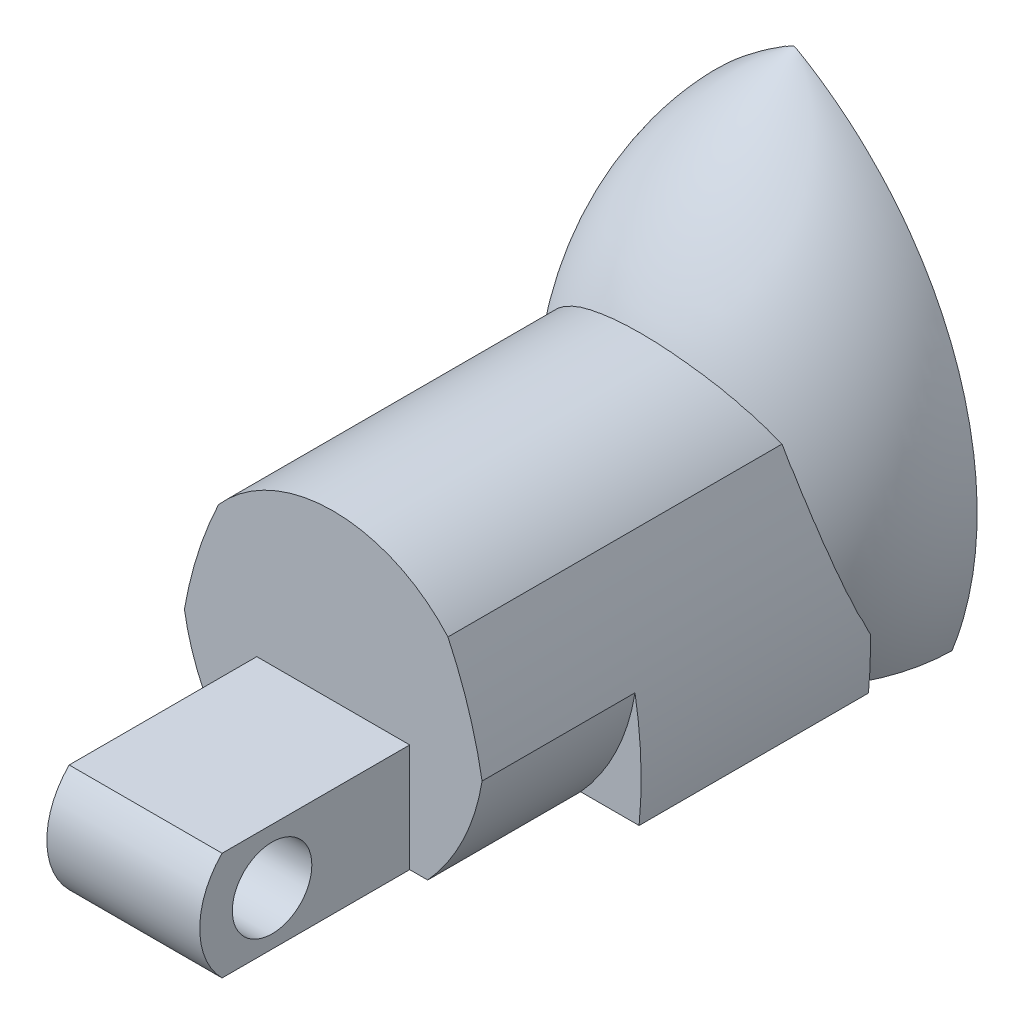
ISO-10303-21;
HEADER;
FILE_DESCRIPTION(('STEP AP214'),'2;1');
FILE_NAME('part.step','',(''),(''),'','','');
FILE_SCHEMA(('AUTOMOTIVE_DESIGN { 1 0 10303 214 1 1 1 1 }'));
ENDSEC;
DATA;
#1=APPLICATION_CONTEXT('core data for automotive mechanical design processes');
#2=APPLICATION_PROTOCOL_DEFINITION('international standard','automotive_design',2000,#1);
#3=PRODUCT_CONTEXT('',#1,'mechanical');
#4=PRODUCT('Part','Part','',(#3));
#5=PRODUCT_RELATED_PRODUCT_CATEGORY('part','',(#4));
#6=PRODUCT_DEFINITION_FORMATION('','',#4);
#7=PRODUCT_DEFINITION_CONTEXT('part definition',#1,'design');
#8=PRODUCT_DEFINITION('design','',#6,#7);
#9=PRODUCT_DEFINITION_SHAPE('','',#8);
#10=(LENGTH_UNIT() NAMED_UNIT(*) SI_UNIT(.MILLI.,.METRE.));
#11=(NAMED_UNIT(*) PLANE_ANGLE_UNIT() SI_UNIT($,.RADIAN.));
#12=(NAMED_UNIT(*) SI_UNIT($,.STERADIAN.) SOLID_ANGLE_UNIT());
#13=UNCERTAINTY_MEASURE_WITH_UNIT(LENGTH_MEASURE(1.E-05),#10,'distance_accuracy_value','');
#14=(GEOMETRIC_REPRESENTATION_CONTEXT(3) GLOBAL_UNCERTAINTY_ASSIGNED_CONTEXT((#13)) GLOBAL_UNIT_ASSIGNED_CONTEXT((#10,
#11,#12)) REPRESENTATION_CONTEXT('',''));
#15=CARTESIAN_POINT('',(0.,0.,0.));
#16=DIRECTION('',(0.,0.,1.));
#17=DIRECTION('',(1.,0.,0.));
#18=AXIS2_PLACEMENT_3D('',#15,#16,#17);
#19=CARTESIAN_POINT('',(0.,8.62971607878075,-5.21391949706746));
#20=DIRECTION('',(0.,-1.,0.));
#21=DIRECTION('',(0.,0.,-1.));
#22=AXIS2_PLACEMENT_3D('',#19,#20,#21);
#23=DEGENERATE_TOROIDAL_SURFACE('',#22,11.5168731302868,23.488997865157,.F.);
#24=CARTESIAN_POINT('',(0.,29.0577639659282,-5.13648884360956));
#25=CARTESIAN_POINT('',(0.00894089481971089,29.0577691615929,-5.13648884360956));
#26=CARTESIAN_POINT('',(0.017882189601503,29.0568491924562,-5.13648884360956));
#27=CARTESIAN_POINT('',(0.0355827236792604,29.0535867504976,-5.13648884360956));
#28=CARTESIAN_POINT('',(0.0443382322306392,29.0512264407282,-5.13648884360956));
#29=CARTESIAN_POINT('',(0.0621360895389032,29.0455137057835,-5.13648884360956));
#30=CARTESIAN_POINT('',(0.0711597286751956,29.0421064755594,-5.13648884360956));
#31=CARTESIAN_POINT('',(0.0890059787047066,29.0347929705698,-5.13648884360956));
#32=CARTESIAN_POINT('',(0.097828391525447,29.0308862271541,-5.13648884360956));
#33=CARTESIAN_POINT('',(0.12415180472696,29.0187323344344,-5.13648884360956));
#34=CARTESIAN_POINT('',(0.141458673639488,29.0100710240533,-5.13648884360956));
#35=CARTESIAN_POINT('',(0.175890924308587,28.9922946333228,-5.13648884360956));
#36=CARTESIAN_POINT('',(0.193015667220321,28.9831783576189,-5.13648884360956));
#37=CARTESIAN_POINT('',(0.227102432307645,28.9647208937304,-5.13648884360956));
#38=CARTESIAN_POINT('',(0.244064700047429,28.9553801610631,-5.13648884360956));
#39=CARTESIAN_POINT('',(0.294469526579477,28.9273415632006,-5.13648884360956));
#40=CARTESIAN_POINT('',(0.327794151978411,28.9084328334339,-5.13648884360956));
#41=CARTESIAN_POINT('',(0.394262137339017,28.8702973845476,-5.13648884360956));
#42=CARTESIAN_POINT('',(0.427405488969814,28.851070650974,-5.13648884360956));
#43=CARTESIAN_POINT('',(0.526678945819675,28.7930020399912,-5.13648884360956));
#44=CARTESIAN_POINT('',(0.592599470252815,28.7538017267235,-5.13648884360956));
#45=CARTESIAN_POINT('',(0.723726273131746,28.6748212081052,-5.13648884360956));
#46=CARTESIAN_POINT('',(0.788934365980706,28.6350440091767,-5.13648884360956));
#47=CARTESIAN_POINT('',(0.918909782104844,28.5548154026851,-5.13648884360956));
#48=CARTESIAN_POINT('',(0.983677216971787,28.5143641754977,-5.13648884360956));
#49=CARTESIAN_POINT('',(1.30745843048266,28.3098625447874,-5.13648884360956));
#50=CARTESIAN_POINT('',(1.56337791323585,28.140869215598,-5.13648884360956));
#51=CARTESIAN_POINT('',(2.06841100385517,27.7929123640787,-5.13648884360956));
#52=CARTESIAN_POINT('',(2.31752301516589,27.6139465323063,-5.13648884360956));
#53=CARTESIAN_POINT('',(2.80931049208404,27.2457798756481,-5.13648884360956));
#54=CARTESIAN_POINT('',(3.05196310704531,27.0565484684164,-5.13648884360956));
#55=CARTESIAN_POINT('',(3.52963726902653,26.6686954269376,-5.13648884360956));
#56=CARTESIAN_POINT('',(3.76465826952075,26.4700731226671,-5.13648884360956));
#57=CARTESIAN_POINT('',(4.46279467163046,25.8561096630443,-5.13648884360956));
#58=CARTESIAN_POINT('',(4.91368172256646,25.4266385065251,-5.13648884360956));
#59=CARTESIAN_POINT('',(5.56327927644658,24.7567106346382,-5.13648884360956));
#60=CARTESIAN_POINT('',(5.77540197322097,24.5290592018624,-5.13648884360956));
#61=CARTESIAN_POINT('',(6.19048529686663,24.0654585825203,-5.13648884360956));
#62=CARTESIAN_POINT('',(6.39344410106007,23.8295077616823,-5.13648884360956));
#63=CARTESIAN_POINT('',(6.98785202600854,23.1100196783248,-5.13648884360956));
#64=CARTESIAN_POINT('',(7.36506674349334,22.6146053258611,-5.13648884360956));
#65=CARTESIAN_POINT('',(8.07897527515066,21.5953767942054,-5.13648884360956));
#66=CARTESIAN_POINT('',(8.4156679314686,21.0715618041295,-5.13648884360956));
#67=CARTESIAN_POINT('',(8.89830355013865,20.2507678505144,-5.13648884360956));
#68=CARTESIAN_POINT('',(9.05960102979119,19.9627227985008,-5.13648884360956));
#69=CARTESIAN_POINT('',(9.36987935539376,19.3801638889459,-5.13648884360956));
#70=CARTESIAN_POINT('',(9.5188630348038,19.0856515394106,-5.13648884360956));
#71=CARTESIAN_POINT('',(9.94703042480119,18.1929976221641,-5.13648884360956));
#72=CARTESIAN_POINT('',(10.2074433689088,17.5857172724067,-5.13648884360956));
#73=CARTESIAN_POINT('',(10.6762691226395,16.3511987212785,-5.13648884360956));
#74=CARTESIAN_POINT('',(10.8846596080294,15.7239520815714,-5.13648884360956));
#75=CARTESIAN_POINT('',(11.2478629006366,14.4541219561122,-5.13648884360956));
#76=CARTESIAN_POINT('',(11.4026766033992,13.8115387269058,-5.13648884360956));
#77=CARTESIAN_POINT('',(11.657627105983,12.5155670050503,-5.13648884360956));
#78=CARTESIAN_POINT('',(11.7577594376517,11.8621776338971,-5.13648884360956));
#79=CARTESIAN_POINT('',(11.9026199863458,10.549281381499,-5.13648884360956));
#80=CARTESIAN_POINT('',(11.9473479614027,9.88977447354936,-5.13648884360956));
#81=CARTESIAN_POINT('',(11.9810754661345,8.5695051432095,-5.13648884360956));
#82=CARTESIAN_POINT('',(11.9700891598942,7.90874308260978,-5.13648884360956));
#83=CARTESIAN_POINT('',(11.8925001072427,6.59049594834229,-5.13648884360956));
#84=CARTESIAN_POINT('',(11.8258975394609,5.93301086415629,-5.13648884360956));
#85=CARTESIAN_POINT('',(11.6375577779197,4.62606281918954,-5.13648884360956));
#86=CARTESIAN_POINT('',(11.5158274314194,3.97659887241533,-5.13648884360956));
#87=CARTESIAN_POINT('',(11.2181102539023,2.69024582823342,-5.13648884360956));
#88=CARTESIAN_POINT('',(11.0421229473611,2.05335684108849,-5.13648884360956));
#89=CARTESIAN_POINT('',(10.6369870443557,0.796248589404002,-5.13648884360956));
#90=CARTESIAN_POINT('',(10.4078100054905,0.176038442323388,-5.13648884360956));
#91=CARTESIAN_POINT('',(10.0255581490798,-0.737938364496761,-5.13648884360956));
#92=CARTESIAN_POINT('',(9.89172191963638,-1.0398829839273,-5.13648884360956));
#93=CARTESIAN_POINT('',(9.61140481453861,-1.63794178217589,-5.13648884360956));
#94=CARTESIAN_POINT('',(9.46492068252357,-1.93405443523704,-5.13648884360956));
#95=CARTESIAN_POINT('',(9.00673408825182,-2.81308175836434,-5.13648884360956));
#96=CARTESIAN_POINT('',(8.67641069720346,-3.3864150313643,-5.13648884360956));
#97=CARTESIAN_POINT('',(7.96857860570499,-4.50316588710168,-5.13648884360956));
#98=CARTESIAN_POINT('',(7.59107029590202,-5.04658371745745,-5.13648884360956));
#99=CARTESIAN_POINT('',(6.99188196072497,-5.83583249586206,-5.13648884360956));
#100=CARTESIAN_POINT('',(6.7868278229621,-6.09442165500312,-5.13648884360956));
#101=CARTESIAN_POINT('',(6.36606539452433,-6.60266847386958,-5.13648884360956));
#102=CARTESIAN_POINT('',(6.15035956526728,-6.85232817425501,-5.13648884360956));
#103=CARTESIAN_POINT('',(5.4879139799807,-7.58713515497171,-5.13648884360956));
#104=CARTESIAN_POINT('',(5.02558562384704,-8.05845336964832,-5.13648884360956));
#105=CARTESIAN_POINT('',(4.28360939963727,-8.75371353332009,-5.13648884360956));
#106=CARTESIAN_POINT('',(4.01727376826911,-8.99208817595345,-5.13648884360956));
#107=CARTESIAN_POINT('',(3.47413100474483,-9.45631530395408,-5.13648884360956));
#108=CARTESIAN_POINT('',(3.1973304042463,-9.68217539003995,-5.13648884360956));
#109=CARTESIAN_POINT('',(2.72233213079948,-10.0520071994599,-5.13648884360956));
#110=CARTESIAN_POINT('',(2.52678212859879,-10.1993993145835,-5.13648884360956));
#111=CARTESIAN_POINT('',(2.13113603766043,-10.4879900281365,-5.13648884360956));
#112=CARTESIAN_POINT('',(1.93103970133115,-10.6291882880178,-5.13648884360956));
#113=CARTESIAN_POINT('',(1.60129257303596,-10.8541667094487,-5.13648884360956));
#114=CARTESIAN_POINT('',(1.47295063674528,-10.9398733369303,-5.13648884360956));
#115=CARTESIAN_POINT('',(1.21458536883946,-11.1086882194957,-5.13648884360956));
#116=CARTESIAN_POINT('',(1.08456222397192,-11.1917967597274,-5.13648884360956));
#117=CARTESIAN_POINT('',(0.87799758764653,-11.3208254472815,-5.13648884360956));
#118=CARTESIAN_POINT('',(0.802020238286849,-11.3676514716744,-5.13648884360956));
#119=CARTESIAN_POINT('',(0.649465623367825,-11.4603459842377,-5.13648884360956));
#120=CARTESIAN_POINT('',(0.572888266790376,-11.5062143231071,-5.13648884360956));
#121=CARTESIAN_POINT('',(0.454421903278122,-11.5759141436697,-5.13648884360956));
#122=CARTESIAN_POINT('',(0.412784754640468,-11.6001741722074,-5.13648884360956));
#123=CARTESIAN_POINT('',(0.329257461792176,-11.6482137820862,-5.13648884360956));
#124=CARTESIAN_POINT('',(0.287367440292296,-11.6719935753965,-5.13648884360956));
#125=CARTESIAN_POINT('',(0.223279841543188,-11.7073956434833,-5.13648884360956));
#126=CARTESIAN_POINT('',(0.201281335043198,-11.7193746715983,-5.13648884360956));
#127=CARTESIAN_POINT('',(0.168039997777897,-11.736923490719,-5.13648884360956));
#128=CARTESIAN_POINT('',(0.156910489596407,-11.7427073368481,-5.13648884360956));
#129=CARTESIAN_POINT('',(0.134531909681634,-11.7540376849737,-5.13648884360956));
#130=CARTESIAN_POINT('',(0.123282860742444,-11.7595842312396,-5.13648884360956));
#131=CARTESIAN_POINT('',(0.100236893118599,-11.7704158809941,-5.13648884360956));
#132=CARTESIAN_POINT('',(0.0884337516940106,-11.7756877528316,-5.13648884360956));
#133=CARTESIAN_POINT('',(0.0644398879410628,-11.7853002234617,-5.13648884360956));
#134=CARTESIAN_POINT('',(0.0522497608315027,-11.7896421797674,-5.13648884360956));
#135=CARTESIAN_POINT('',(0.0310985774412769,-11.7951144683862,-5.13648884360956));
#136=CARTESIAN_POINT('',(0.0223021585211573,-11.7968224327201,-5.13648884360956));
#137=CARTESIAN_POINT('',(0.00458132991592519,-11.7985265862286,-5.13648884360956));
#138=CARTESIAN_POINT('',(-0.00434180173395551,-11.7985343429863,-5.13648884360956));
#139=CARTESIAN_POINT('',(-0.0247428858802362,-11.7966076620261,-5.13648884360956));
#140=CARTESIAN_POINT('',(-0.0361549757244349,-11.7940701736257,-5.13648884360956));
#141=CARTESIAN_POINT('',(-0.0586159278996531,-11.7874294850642,-5.13648884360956));
#142=CARTESIAN_POINT('',(-0.0696572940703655,-11.7833044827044,-5.13648884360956));
#143=CARTESIAN_POINT('',(-0.0927227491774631,-11.7738211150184,-5.13648884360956));
#144=CARTESIAN_POINT('',(-0.104709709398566,-11.7683747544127,-5.13648884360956));
#145=CARTESIAN_POINT('',(-0.128480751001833,-11.7570513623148,-5.13648884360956));
#146=CARTESIAN_POINT('',(-0.140264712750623,-11.7511740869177,-5.13648884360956));
#147=CARTESIAN_POINT('',(-0.175473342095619,-11.7331856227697,-5.13648884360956));
#148=CARTESIAN_POINT('',(-0.198722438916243,-11.7207327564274,-5.13648884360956));
#149=CARTESIAN_POINT('',(-0.244896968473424,-11.6955279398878,-5.13648884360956));
#150=CARTESIAN_POINT('',(-0.267823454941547,-11.6827778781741,-5.13648884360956));
#151=CARTESIAN_POINT('',(-0.313530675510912,-11.6570661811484,-5.13648884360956));
#152=CARTESIAN_POINT('',(-0.336311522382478,-11.6441047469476,-5.13648884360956));
#153=CARTESIAN_POINT('',(-0.404412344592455,-11.6050585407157,-5.13648884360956));
#154=CARTESIAN_POINT('',(-0.449603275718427,-11.5787492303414,-5.13648884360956));
#155=CARTESIAN_POINT('',(-0.539742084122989,-11.5257158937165,-5.13648884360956));
#156=CARTESIAN_POINT('',(-0.584689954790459,-11.4989918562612,-5.13648884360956));
#157=CARTESIAN_POINT('',(-0.719249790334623,-11.4182651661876,-5.13648884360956));
#158=CARTESIAN_POINT('',(-0.808541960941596,-11.3637287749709,-5.13648884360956));
#159=CARTESIAN_POINT('',(-0.986426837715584,-11.2533463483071,-5.13648884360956));
#160=CARTESIAN_POINT('',(-1.07501882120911,-11.1974991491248,-5.13648884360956));
#161=CARTESIAN_POINT('',(-1.25141283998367,-11.0845949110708,-5.13648884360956));
#162=CARTESIAN_POINT('',(-1.33921495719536,-11.027537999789,-5.13648884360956));
#163=CARTESIAN_POINT('',(-1.7781975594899,-10.7380181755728,-5.13648884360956));
#164=CARTESIAN_POINT('',(-2.12349569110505,-10.4965245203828,-5.13648884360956));
#165=CARTESIAN_POINT('',(-2.80064300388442,-9.99523689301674,-5.13648884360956));
#166=CARTESIAN_POINT('',(-3.13248832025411,-9.73543771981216,-5.13648884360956));
#167=CARTESIAN_POINT('',(-3.78224010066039,-9.19790687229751,-5.13648884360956));
#168=CARTESIAN_POINT('',(-4.1001234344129,-8.92014719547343,-5.13648884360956));
#169=CARTESIAN_POINT('',(-4.72046055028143,-8.34790425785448,-5.13648884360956));
#170=CARTESIAN_POINT('',(-5.02291331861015,-8.05341990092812,-5.13648884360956));
#171=CARTESIAN_POINT('',(-5.77754956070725,-7.27794044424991,-5.13648884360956));
#172=CARTESIAN_POINT('',(-6.21798846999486,-6.78541515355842,-5.13648884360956));
#173=CARTESIAN_POINT('',(-7.05590311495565,-5.76491486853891,-5.13648884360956));
#174=CARTESIAN_POINT('',(-7.45336583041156,-5.23692920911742,-5.13648884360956));
#175=CARTESIAN_POINT('',(-8.20247425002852,-4.14925228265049,-5.13648884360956));
#176=CARTESIAN_POINT('',(-8.55411255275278,-3.58955591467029,-5.13648884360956));
#177=CARTESIAN_POINT('',(-9.20895541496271,-2.44257589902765,-5.13648884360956));
#178=CARTESIAN_POINT('',(-9.51216376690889,-1.8552944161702,-5.13648884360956));
#179=CARTESIAN_POINT('',(-10.067992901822,-0.657353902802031,-5.13648884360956));
#180=CARTESIAN_POINT('',(-10.3206203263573,-0.0466979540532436,-5.13648884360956));
#181=CARTESIAN_POINT('',(-10.7735455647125,1.19373478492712,-5.13648884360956));
#182=CARTESIAN_POINT('',(-10.9738423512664,1.82351195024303,-5.13648884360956));
#183=CARTESIAN_POINT('',(-11.3206931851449,3.09776016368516,-5.13648884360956));
#184=CARTESIAN_POINT('',(-11.4672421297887,3.7422326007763,-5.13648884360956));
#185=CARTESIAN_POINT('',(-11.7055282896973,5.04122886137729,-5.13648884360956));
#186=CARTESIAN_POINT('',(-11.7972657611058,5.69575263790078,-5.13648884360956));
#187=CARTESIAN_POINT('',(-11.9252854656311,7.01027852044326,-5.13648884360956));
#188=CARTESIAN_POINT('',(-11.9615612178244,7.67028125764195,-5.13648884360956));
#189=CARTESIAN_POINT('',(-11.9783791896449,8.99099738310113,-5.13648884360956));
#190=CARTESIAN_POINT('',(-11.9589213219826,9.65171077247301,-5.13648884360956));
#191=CARTESIAN_POINT('',(-11.8644182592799,10.9690336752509,-5.13648884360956));
#192=CARTESIAN_POINT('',(-11.7893828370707,11.6256438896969,-5.13648884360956));
#193=CARTESIAN_POINT('',(-11.5842705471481,12.9302069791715,-5.13648884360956));
#194=CARTESIAN_POINT('',(-11.4541938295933,13.5781598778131,-5.13648884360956));
#195=CARTESIAN_POINT('',(-11.1399499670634,14.8606864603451,-5.13648884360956));
#196=CARTESIAN_POINT('',(-10.9557933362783,15.495262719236,-5.13648884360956));
#197=CARTESIAN_POINT('',(-10.5347015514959,16.7466374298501,-5.13648884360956));
#198=CARTESIAN_POINT('',(-10.2977659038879,17.3634357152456,-5.13648884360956));
#199=CARTESIAN_POINT('',(-9.77259043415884,18.5753143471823,-5.13648884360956));
#200=CARTESIAN_POINT('',(-9.48432070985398,19.1703817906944,-5.13648884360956));
#201=CARTESIAN_POINT('',(-9.01519451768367,20.042985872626,-5.13648884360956));
#202=CARTESIAN_POINT('',(-8.85269373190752,20.3305289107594,-5.13648884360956));
#203=CARTESIAN_POINT('',(-8.51567197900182,20.8985850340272,-5.13648884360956));
#204=CARTESIAN_POINT('',(-8.3411479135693,21.1790962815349,-5.13648884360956));
#205=CARTESIAN_POINT('',(-7.79981179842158,22.009575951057,-5.13648884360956));
#206=CARTESIAN_POINT('',(-7.41539233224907,22.5481992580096,-5.13648884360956));
#207=CARTESIAN_POINT('',(-6.6024852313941,23.5910851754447,-5.13648884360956));
#208=CARTESIAN_POINT('',(-6.17399803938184,24.095348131,-5.13648884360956));
#209=CARTESIAN_POINT('',(-5.50103247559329,24.8227491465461,-5.13648884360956));
#210=CARTESIAN_POINT('',(-5.27186928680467,25.0602033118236,-5.13648884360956));
#211=CARTESIAN_POINT('',(-4.8038050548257,25.5251878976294,-5.13648884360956));
#212=CARTESIAN_POINT('',(-4.56490621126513,25.7527205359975,-5.13648884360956));
#213=CARTESIAN_POINT('',(-3.83433970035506,26.4197131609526,-5.13648884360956));
#214=CARTESIAN_POINT('',(-3.32849210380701,26.8439028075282,-5.13648884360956));
#215=CARTESIAN_POINT('',(-2.56677852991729,27.4297740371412,-5.13648884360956));
#216=CARTESIAN_POINT('',(-2.3241735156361,27.6090233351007,-5.13648884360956));
#217=CARTESIAN_POINT('',(-1.83233621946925,27.9579175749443,-5.13648884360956));
#218=CARTESIAN_POINT('',(-1.58310817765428,28.127568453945,-5.13648884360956));
#219=CARTESIAN_POINT('',(-1.20104723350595,28.3768332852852,-5.13648884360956));
#220=CARTESIAN_POINT('',(-1.07057838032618,28.4600954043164,-5.13648884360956));
#221=CARTESIAN_POINT('',(-0.873565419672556,28.5829491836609,-5.13648884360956));
#222=CARTESIAN_POINT('',(-0.807662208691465,28.6235688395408,-5.13648884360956));
#223=CARTESIAN_POINT('',(-0.675415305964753,28.704080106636,-5.13648884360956));
#224=CARTESIAN_POINT('',(-0.609071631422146,28.7439717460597,-5.13648884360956));
#225=CARTESIAN_POINT('',(-0.514224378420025,28.800179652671,-5.13648884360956));
#226=CARTESIAN_POINT('',(-0.485927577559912,28.8168452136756,-5.13648884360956));
#227=CARTESIAN_POINT('',(-0.429226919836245,28.8499984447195,-5.13648884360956));
#228=CARTESIAN_POINT('',(-0.400823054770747,28.8664861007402,-5.13648884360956));
#229=CARTESIAN_POINT('',(-0.343915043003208,28.8992159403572,-5.13648884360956));
#230=CARTESIAN_POINT('',(-0.315411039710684,28.9154583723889,-5.13648884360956));
#231=CARTESIAN_POINT('',(-0.258215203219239,28.9475944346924,-5.13648884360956));
#232=CARTESIAN_POINT('',(-0.229523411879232,28.9634881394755,-5.13648884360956));
#233=CARTESIAN_POINT('',(-0.178716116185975,28.9908325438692,-5.13648884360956));
#234=CARTESIAN_POINT('',(-0.156682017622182,29.0024309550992,-5.13648884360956));
#235=CARTESIAN_POINT('',(-0.123160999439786,29.0190537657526,-5.13648884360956));
#236=CARTESIAN_POINT('',(-0.111875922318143,29.0244800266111,-5.13648884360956));
#237=CARTESIAN_POINT('',(-0.0890669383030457,29.0347960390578,-5.13648884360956));
#238=CARTESIAN_POINT('',(-0.0775432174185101,29.0396861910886,-5.13648884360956));
#239=CARTESIAN_POINT('',(-0.0551551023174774,29.0479485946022,-5.13648884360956));
#240=CARTESIAN_POINT('',(-0.0443298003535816,29.0514200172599,-5.13648884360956));
#241=CARTESIAN_POINT('',(-0.0223308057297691,29.0563081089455,-5.13648884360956));
#242=CARTESIAN_POINT('',(-0.0111657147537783,29.0577574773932,-5.13648884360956));
#243=CARTESIAN_POINT('',(0.,29.0577639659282,-5.13648884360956));
#244=B_SPLINE_CURVE_WITH_KNOTS('',3,(#24,#25,#26,#27,#28,#29,#30,#31,#32,#33,#34,#35,#36,#37,
#38,#39,#40,#41,#42,#43,#44,#45,#46,#47,#48,#49,#50,#51,#52,#53,#54,#55,#56,#57,#58,#59,#60,#61,
#62,#63,#64,#65,#66,#67,#68,#69,#70,#71,#72,#73,#74,#75,#76,#77,#78,#79,#80,#81,#82,#83,#84,#85,
#86,#87,#88,#89,#90,#91,#92,#93,#94,#95,#96,#97,#98,#99,#100,#101,#102,#103,#104,#105,#106,#107,
#108,#109,#110,#111,#112,#113,#114,#115,#116,#117,#118,#119,#120,#121,#122,#123,#124,#125,#126,
#127,#128,#129,#130,#131,#132,#133,#134,#135,#136,#137,#138,#139,#140,#141,#142,#143,#144,#145,
#146,#147,#148,#149,#150,#151,#152,#153,#154,#155,#156,#157,#158,#159,#160,#161,#162,#163,#164,
#165,#166,#167,#168,#169,#170,#171,#172,#173,#174,#175,#176,#177,#178,#179,#180,#181,#182,#183,
#184,#185,#186,#187,#188,#189,#190,#191,#192,#193,#194,#195,#196,#197,#198,#199,#200,#201,#202,
#203,#204,#205,#206,#207,#208,#209,#210,#211,#212,#213,#214,#215,#216,#217,#218,#219,#220,#221,
#222,#223,#224,#225,#226,#227,#228,#229,#230,#231,#232,#233,#234,#235,#236,#237,#238,#239,#240,
#241,#242,#243),.UNSPECIFIED.,.T.,.F.,(4,2,2,2,2,2,2,2,2,2,2,2,2,2,2,2,2,2,2,2,2,2,2,2,2,2,2,2,
2,2,2,2,2,2,2,2,2,2,2,2,2,2,2,2,2,2,2,2,2,2,2,2,2,2,2,2,2,2,2,2,2,2,2,2,2,2,2,2,2,2,2,2,2,2,2,2,
2,2,2,2,2,2,2,2,2,2,2,2,2,2,2,2,2,2,2,2,2,2,2,2,2,2,2,2,2,2,2,2,2,4),(0.,0.0267971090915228,
0.0539330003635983,0.0828442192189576,0.111782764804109,0.1698213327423,0.228021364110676,
0.286111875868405,0.401054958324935,0.516003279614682,0.746082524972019,0.975226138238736,
1.20430938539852,2.12407449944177,3.04405350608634,3.96694235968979,4.8898971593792,
6.7556182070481,7.68890787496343,8.62238236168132,10.4883253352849,12.3543216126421,
13.3444526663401,14.3343552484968,16.3140843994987,18.2946616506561,20.2752057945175,
22.2559117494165,24.2366263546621,26.2168374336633,28.1970421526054,30.1770009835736,
32.15697716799,34.1380145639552,35.128592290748,36.1194258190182,38.101970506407,
40.0844987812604,41.0743074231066,42.063888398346,44.0417620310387,45.1137690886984,
46.1851177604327,46.9196408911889,47.6542041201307,48.1171634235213,48.5800717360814,
48.8478109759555,49.1155916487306,49.2601578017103,49.4046586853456,49.4797992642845,
49.5174262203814,49.5550461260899,49.59381957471,49.6325360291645,49.6593026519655,
49.6858871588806,49.7207159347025,49.756041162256,49.7955205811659,49.8350225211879,
49.9141331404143,49.9928330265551,50.0714619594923,50.2283331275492,50.3852085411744,
50.6990841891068,51.013249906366,51.3273826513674,52.5907779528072,53.854533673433,
55.1203095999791,56.3861685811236,58.3658640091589,60.346157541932,62.3267705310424,
64.3072283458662,66.2874259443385,68.2676624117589,70.2480868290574,72.2285019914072,
74.2091485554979,76.1897982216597,78.170099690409,80.1503957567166,82.13030706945,
84.1102368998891,86.0913238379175,87.0819234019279,88.0727791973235,90.0554789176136,
92.0381587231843,93.0278968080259,94.0174125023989,95.9950789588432,96.8998489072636,
97.8040529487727,98.2683442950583,98.500587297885,98.7328212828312,98.8313400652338,
98.9298665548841,99.028285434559,99.1266830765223,99.2013690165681,99.2389283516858,
99.2764594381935,99.310481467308,99.3439466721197),.UNSPECIFIED.);
#245=CARTESIAN_POINT('',(-10.3291411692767,0.,-5.13648884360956));
#246=VERTEX_POINT('',#245);
#247=CARTESIAN_POINT('',(10.3291411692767,0.,-5.13648884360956));
#248=VERTEX_POINT('',#247);
#249=EDGE_CURVE('E130',#246,#248,#244,.T.);
#250=ORIENTED_EDGE('',*,*,#249,.F.);
#251=CARTESIAN_POINT('',(0.,0.,-5.21391949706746));
#252=DIRECTION('',(0.,-1.,0.));
#253=DIRECTION('',(0.,0.,-1.));
#254=AXIS2_PLACEMENT_3D('',#251,#252,#253);
#255=CIRCLE('',#254,10.3294313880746);
#256=EDGE_CURVE('E125',#248,#246,#255,.T.);
#257=ORIENTED_EDGE('',*,*,#256,.F.);
#258=EDGE_LOOP('',(#250,#257));
#259=FACE_BOUND('',#258,.T.);
#260=ADVANCED_FACE('F117',(#259),#23,.F.);
#261=CARTESIAN_POINT('',(0.,0.,5.11551189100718));
#262=DIRECTION('',(0.,1.,0.));
#263=DIRECTION('',(0.,0.,1.));
#264=AXIS2_PLACEMENT_3D('',#261,#262,#263);
#265=PLANE('',#264);
#266=DIRECTION('',(-1.,0.,0.));
#267=VECTOR('',#266,1.);
#268=CARTESIAN_POINT('',(0.,0.,-5.13648884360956));
#269=LINE('',#268,#267);
#270=EDGE_CURVE('E13',#248,#246,#269,.T.);
#271=ORIENTED_EDGE('',*,*,#270,.F.);
#272=ORIENTED_EDGE('',*,*,#256,.T.);
#273=EDGE_LOOP('',(#271,#272));
#274=FACE_BOUND('',#273,.T.);
#275=ADVANCED_FACE('F138',(#274),#265,.F.);
#276=CARTESIAN_POINT('',(40.,30.0275957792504,-5.13648884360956));
#277=DIRECTION('',(0.,0.,-1.));
#278=DIRECTION('',(-1.,0.,0.));
#279=AXIS2_PLACEMENT_3D('',#276,#277,#278);
#280=PLANE('',#279);
#281=ORIENTED_EDGE('',*,*,#249,.T.);
#282=ORIENTED_EDGE('',*,*,#270,.T.);
#283=EDGE_LOOP('',(#281,#282));
#284=FACE_BOUND('',#283,.T.);
#285=ADVANCED_FACE('F132',(#284),#280,.T.);
#286=CLOSED_SHELL('',(#260,#275,#285));
#287=MANIFOLD_SOLID_BREP('B2',#286);
#288=CARTESIAN_POINT('',(0.,7.81562172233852,25.));
#289=DIRECTION('',(0.,0.,-1.));
#290=DIRECTION('',(-1.,0.,0.));
#291=AXIS2_PLACEMENT_3D('',#288,#289,#290);
#292=CYLINDRICAL_SURFACE('',#291,10.);
#293=CARTESIAN_POINT('',(0.,7.81562172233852,0.));
#294=DIRECTION('',(0.,0.,1.));
#295=DIRECTION('',(1.,0.,0.));
#296=AXIS2_PLACEMENT_3D('',#293,#294,#295);
#297=CIRCLE('',#296,10.);
#298=CARTESIAN_POINT('',(-7.5,14.43,0.));
#299=VERTEX_POINT('',#298);
#300=CARTESIAN_POINT('',(7.5,14.43,0.));
#301=VERTEX_POINT('',#300);
#302=EDGE_CURVE('E533',#299,#301,#297,.F.);
#303=ORIENTED_EDGE('',*,*,#302,.F.);
#304=DIRECTION('',(0.,0.,-1.));
#305=VECTOR('',#304,1.);
#306=CARTESIAN_POINT('',(-7.5,14.43,25.));
#307=LINE('',#306,#305);
#308=CARTESIAN_POINT('',(-7.5,14.43,25.));
#309=VERTEX_POINT('',#308);
#310=EDGE_CURVE('E502',#309,#299,#307,.T.);
#311=ORIENTED_EDGE('',*,*,#310,.F.);
#312=CARTESIAN_POINT('',(0.,7.81562172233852,25.));
#313=DIRECTION('',(0.,0.,1.));
#314=DIRECTION('',(1.,0.,0.));
#315=AXIS2_PLACEMENT_3D('',#312,#313,#314);
#316=CIRCLE('',#315,10.);
#317=CARTESIAN_POINT('',(7.5,14.43,25.));
#318=VERTEX_POINT('',#317);
#319=EDGE_CURVE('E486',#309,#318,#316,.F.);
#320=ORIENTED_EDGE('',*,*,#319,.T.);
#321=DIRECTION('',(0.,0.,-1.));
#322=VECTOR('',#321,1.);
#323=CARTESIAN_POINT('',(7.5,14.43,25.));
#324=LINE('',#323,#322);
#325=EDGE_CURVE('E507',#318,#301,#324,.T.);
#326=ORIENTED_EDGE('',*,*,#325,.T.);
#327=EDGE_LOOP('',(#303,#311,#320,#326));
#328=FACE_BOUND('',#327,.T.);
#329=ADVANCED_FACE('F168',(#328),#292,.T.);
#330=CARTESIAN_POINT('',(0.,0.,25.));
#331=DIRECTION('',(0.,0.,1.));
#332=DIRECTION('',(1.,0.,0.));
#333=AXIS2_PLACEMENT_3D('',#330,#331,#332);
#334=PLANE('',#333);
#335=DIRECTION('',(0.,1.,0.));
#336=VECTOR('',#335,1.);
#337=CARTESIAN_POINT('',(5.,7.06562172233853,25.));
#338=LINE('',#337,#336);
#339=CARTESIAN_POINT('',(5.,0.,25.));
#340=VERTEX_POINT('',#339);
#341=CARTESIAN_POINT('',(5.,7.06562172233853,25.));
#342=VERTEX_POINT('',#341);
#343=EDGE_CURVE('E312',#340,#342,#338,.T.);
#344=ORIENTED_EDGE('',*,*,#343,.F.);
#345=DIRECTION('',(-1.,0.,0.));
#346=VECTOR('',#345,1.);
#347=CARTESIAN_POINT('',(0.,0.,25.));
#348=LINE('',#347,#346);
#349=CARTESIAN_POINT('',(6.17497071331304,0.,25.));
#350=VERTEX_POINT('',#349);
#351=EDGE_CURVE('E519',#350,#340,#348,.T.);
#352=ORIENTED_EDGE('',*,*,#351,.F.);
#353=CARTESIAN_POINT('',(-4.46578449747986,9.67695971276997,25.));
#354=DIRECTION('',(0.,0.,-1.));
#355=DIRECTION('',(-1.,0.,0.));
#356=AXIS2_PLACEMENT_3D('',#353,#354,#355);
#357=CIRCLE('',#356,14.3829489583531);
#358=CARTESIAN_POINT('',(9.73343681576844,7.3853805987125,25.));
#359=VERTEX_POINT('',#358);
#360=EDGE_CURVE('E352',#359,#350,#357,.T.);
#361=ORIENTED_EDGE('',*,*,#360,.F.);
#362=CARTESIAN_POINT('',(-17.2247633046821,2.71486775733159,25.));
#363=DIRECTION('',(0.,0.,1.));
#364=DIRECTION('',(1.,0.,0.));
#365=AXIS2_PLACEMENT_3D('',#362,#363,#364);
#366=CIRCLE('',#365,27.3597924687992);
#367=EDGE_CURVE('E514',#318,#359,#366,.F.);
#368=ORIENTED_EDGE('',*,*,#367,.F.);
#369=ORIENTED_EDGE('',*,*,#319,.F.);
#370=CARTESIAN_POINT('',(17.2247633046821,2.7148677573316,25.));
#371=DIRECTION('',(0.,0.,1.));
#372=DIRECTION('',(1.,0.,0.));
#373=AXIS2_PLACEMENT_3D('',#370,#371,#372);
#374=CIRCLE('',#373,27.3597924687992);
#375=CARTESIAN_POINT('',(-9.73343681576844,7.3853805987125,25.));
#376=VERTEX_POINT('',#375);
#377=EDGE_CURVE('E483',#309,#376,#374,.T.);
#378=ORIENTED_EDGE('',*,*,#377,.T.);
#379=CARTESIAN_POINT('',(4.46578449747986,9.67695971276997,25.));
#380=DIRECTION('',(0.,0.,-1.));
#381=DIRECTION('',(1.,0.,0.));
#382=AXIS2_PLACEMENT_3D('',#379,#380,#381);
#383=CIRCLE('',#382,14.3829489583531);
#384=CARTESIAN_POINT('',(-6.17497071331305,0.,25.));
#385=VERTEX_POINT('',#384);
#386=EDGE_CURVE('E344',#385,#376,#383,.T.);
#387=ORIENTED_EDGE('',*,*,#386,.F.);
#388=CARTESIAN_POINT('',(-5.,0.,25.));
#389=VERTEX_POINT('',#388);
#390=EDGE_CURVE('E478',#389,#385,#348,.T.);
#391=ORIENTED_EDGE('',*,*,#390,.F.);
#392=DIRECTION('',(0.,1.,0.));
#393=VECTOR('',#392,1.);
#394=CARTESIAN_POINT('',(-5.,7.06562172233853,25.));
#395=LINE('',#394,#393);
#396=CARTESIAN_POINT('',(-5.,7.06562172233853,25.));
#397=VERTEX_POINT('',#396);
#398=EDGE_CURVE('E327',#389,#397,#395,.T.);
#399=ORIENTED_EDGE('',*,*,#398,.T.);
#400=DIRECTION('',(1.,0.,0.));
#401=VECTOR('',#400,1.);
#402=CARTESIAN_POINT('',(-5.,7.06562172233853,25.));
#403=LINE('',#402,#401);
#404=EDGE_CURVE('E304',#397,#342,#403,.T.);
#405=ORIENTED_EDGE('',*,*,#404,.T.);
#406=EDGE_LOOP('',(#344,#352,#361,#368,#369,#378,#387,#391,#399,#405));
#407=FACE_BOUND('',#406,.T.);
#408=ADVANCED_FACE('F325',(#407),#334,.T.);
#409=CARTESIAN_POINT('',(0.,0.,0.));
#410=DIRECTION('',(0.,0.,1.));
#411=DIRECTION('',(1.,0.,0.));
#412=AXIS2_PLACEMENT_3D('',#409,#410,#411);
#413=PLANE('',#412);
#414=CARTESIAN_POINT('',(-2.91262946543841,4.35884071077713,0.));
#415=DIRECTION('',(0.,0.,-1.));
#416=DIRECTION('',(-1.,0.,0.));
#417=AXIS2_PLACEMENT_3D('',#414,#415,#416);
#418=CIRCLE('',#417,12.);
#419=CARTESIAN_POINT('',(0.,16.,0.));
#420=VERTEX_POINT('',#419);
#421=CARTESIAN_POINT('',(8.45,0.500000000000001,0.));
#422=VERTEX_POINT('',#421);
#423=EDGE_CURVE('E552',#420,#422,#418,.T.);
#424=ORIENTED_EDGE('',*,*,#423,.F.);
#425=CARTESIAN_POINT('',(2.91262946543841,4.35884071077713,0.));
#426=DIRECTION('',(0.,0.,-1.));
#427=DIRECTION('',(1.,0.,0.));
#428=AXIS2_PLACEMENT_3D('',#425,#426,#427);
#429=CIRCLE('',#428,12.);
#430=CARTESIAN_POINT('',(-8.45,0.5,0.));
#431=VERTEX_POINT('',#430);
#432=EDGE_CURVE('E556',#431,#420,#429,.T.);
#433=ORIENTED_EDGE('',*,*,#432,.F.);
#434=DIRECTION('',(-1.,0.,0.));
#435=VECTOR('',#434,1.);
#436=CARTESIAN_POINT('',(8.45,0.5,0.));
#437=LINE('',#436,#435);
#438=EDGE_CURVE('E548',#422,#431,#437,.T.);
#439=ORIENTED_EDGE('',*,*,#438,.F.);
#440=EDGE_LOOP('',(#424,#433,#439));
#441=FACE_BOUND('',#440,.T.);
#442=ORIENTED_EDGE('',*,*,#302,.T.);
#443=CARTESIAN_POINT('',(-17.2247633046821,2.71486775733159,0.));
#444=DIRECTION('',(0.,0.,1.));
#445=DIRECTION('',(1.,0.,0.));
#446=AXIS2_PLACEMENT_3D('',#443,#444,#445);
#447=CIRCLE('',#446,27.3597924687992);
#448=CARTESIAN_POINT('',(10.,0.,0.));
#449=VERTEX_POINT('',#448);
#450=EDGE_CURVE('E492',#301,#449,#447,.F.);
#451=ORIENTED_EDGE('',*,*,#450,.T.);
#452=DIRECTION('',(-1.,0.,0.));
#453=VECTOR('',#452,1.);
#454=CARTESIAN_POINT('',(0.,0.,0.));
#455=LINE('',#454,#453);
#456=CARTESIAN_POINT('',(-10.,0.,0.));
#457=VERTEX_POINT('',#456);
#458=EDGE_CURVE('E518',#449,#457,#455,.T.);
#459=ORIENTED_EDGE('',*,*,#458,.T.);
#460=CARTESIAN_POINT('',(17.2247633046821,2.7148677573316,0.));
#461=DIRECTION('',(0.,0.,1.));
#462=DIRECTION('',(1.,0.,0.));
#463=AXIS2_PLACEMENT_3D('',#460,#461,#462);
#464=CIRCLE('',#463,27.3597924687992);
#465=EDGE_CURVE('E488',#299,#457,#464,.T.);
#466=ORIENTED_EDGE('',*,*,#465,.F.);
#467=EDGE_LOOP('',(#442,#451,#459,#466));
#468=FACE_BOUND('',#467,.T.);
#469=ADVANCED_FACE('F454',(#441,#468),#413,.F.);
#470=CARTESIAN_POINT('',(0.,0.,25.));
#471=DIRECTION('',(0.,-1.,0.));
#472=DIRECTION('',(1.,0.,0.));
#473=AXIS2_PLACEMENT_3D('',#470,#471,#472);
#474=PLANE('',#473);
#475=DIRECTION('',(0.,0.,1.));
#476=VECTOR('',#475,1.);
#477=CARTESIAN_POINT('',(-6.17497071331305,0.,15.));
#478=LINE('',#477,#476);
#479=CARTESIAN_POINT('',(-6.17497071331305,0.,15.));
#480=VERTEX_POINT('',#479);
#481=EDGE_CURVE('E349',#480,#385,#478,.T.);
#482=ORIENTED_EDGE('',*,*,#481,.F.);
#483=DIRECTION('',(1.,0.,0.));
#484=VECTOR('',#483,1.);
#485=CARTESIAN_POINT('',(-10.,0.,15.));
#486=LINE('',#485,#484);
#487=CARTESIAN_POINT('',(-10.,0.,15.));
#488=VERTEX_POINT('',#487);
#489=EDGE_CURVE('E343',#488,#480,#486,.T.);
#490=ORIENTED_EDGE('',*,*,#489,.F.);
#491=DIRECTION('',(0.,0.,-1.));
#492=VECTOR('',#491,1.);
#493=CARTESIAN_POINT('',(-10.,0.,25.));
#494=LINE('',#493,#492);
#495=EDGE_CURVE('E472',#488,#457,#494,.T.);
#496=ORIENTED_EDGE('',*,*,#495,.T.);
#497=ORIENTED_EDGE('',*,*,#458,.F.);
#498=DIRECTION('',(0.,0.,-1.));
#499=VECTOR('',#498,1.);
#500=CARTESIAN_POINT('',(10.,0.,25.));
#501=LINE('',#500,#499);
#502=CARTESIAN_POINT('',(10.,0.,15.));
#503=VERTEX_POINT('',#502);
#504=EDGE_CURVE('E497',#503,#449,#501,.T.);
#505=ORIENTED_EDGE('',*,*,#504,.F.);
#506=DIRECTION('',(1.,0.,0.));
#507=VECTOR('',#506,1.);
#508=CARTESIAN_POINT('',(10.,0.,15.));
#509=LINE('',#508,#507);
#510=CARTESIAN_POINT('',(6.17497071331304,0.,15.));
#511=VERTEX_POINT('',#510);
#512=EDGE_CURVE('E375',#511,#503,#509,.T.);
#513=ORIENTED_EDGE('',*,*,#512,.F.);
#514=DIRECTION('',(0.,0.,1.));
#515=VECTOR('',#514,1.);
#516=CARTESIAN_POINT('',(6.17497071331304,0.,15.));
#517=LINE('',#516,#515);
#518=EDGE_CURVE('E361',#511,#350,#517,.T.);
#519=ORIENTED_EDGE('',*,*,#518,.T.);
#520=ORIENTED_EDGE('',*,*,#351,.T.);
#521=DIRECTION('',(0.,0.,-1.));
#522=VECTOR('',#521,1.);
#523=CARTESIAN_POINT('',(5.,0.,25.));
#524=LINE('',#523,#522);
#525=CARTESIAN_POINT('',(5.,0.,37.27));
#526=VERTEX_POINT('',#525);
#527=EDGE_CURVE('E318',#526,#340,#524,.T.);
#528=ORIENTED_EDGE('',*,*,#527,.F.);
#529=DIRECTION('',(1.,0.,0.));
#530=VECTOR('',#529,1.);
#531=CARTESIAN_POINT('',(-5.,0.,37.27));
#532=LINE('',#531,#530);
#533=CARTESIAN_POINT('',(-5.,0.,37.27));
#534=VERTEX_POINT('',#533);
#535=EDGE_CURVE('E333',#534,#526,#532,.T.);
#536=ORIENTED_EDGE('',*,*,#535,.F.);
#537=DIRECTION('',(0.,0.,-1.));
#538=VECTOR('',#537,1.);
#539=CARTESIAN_POINT('',(-5.,0.,25.));
#540=LINE('',#539,#538);
#541=EDGE_CURVE('E329',#534,#389,#540,.T.);
#542=ORIENTED_EDGE('',*,*,#541,.T.);
#543=ORIENTED_EDGE('',*,*,#390,.T.);
#544=EDGE_LOOP('',(#482,#490,#496,#497,#505,#513,#519,#520,#528,#536,#542,#543));
#545=FACE_BOUND('',#544,.T.);
#546=ADVANCED_FACE('F457',(#545),#474,.T.);
#547=CARTESIAN_POINT('',(17.2247633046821,2.7148677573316,25.));
#548=DIRECTION('',(0.,0.,-1.));
#549=DIRECTION('',(-1.,0.,0.));
#550=AXIS2_PLACEMENT_3D('',#547,#548,#549);
#551=CYLINDRICAL_SURFACE('',#550,27.3597924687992);
#552=CARTESIAN_POINT('',(17.2247633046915,2.71486775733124,15.));
#553=DIRECTION('',(0.,0.,1.));
#554=DIRECTION('',(1.,0.,0.));
#555=AXIS2_PLACEMENT_3D('',#552,#553,#554);
#556=CIRCLE('',#555,27.3597924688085);
#557=CARTESIAN_POINT('',(-9.73343681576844,7.3853805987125,15.));
#558=VERTEX_POINT('',#557);
#559=EDGE_CURVE('E340',#558,#488,#556,.T.);
#560=ORIENTED_EDGE('',*,*,#559,.F.);
#561=DIRECTION('',(0.,0.,1.));
#562=VECTOR('',#561,1.);
#563=CARTESIAN_POINT('',(-9.73343681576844,7.3853805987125,15.));
#564=LINE('',#563,#562);
#565=EDGE_CURVE('E353',#558,#376,#564,.T.);
#566=ORIENTED_EDGE('',*,*,#565,.T.);
#567=ORIENTED_EDGE('',*,*,#377,.F.);
#568=ORIENTED_EDGE('',*,*,#310,.T.);
#569=ORIENTED_EDGE('',*,*,#465,.T.);
#570=ORIENTED_EDGE('',*,*,#495,.F.);
#571=EDGE_LOOP('',(#560,#566,#567,#568,#569,#570));
#572=FACE_BOUND('',#571,.T.);
#573=ADVANCED_FACE('F170',(#572),#551,.T.);
#574=CARTESIAN_POINT('',(-17.2247633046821,2.71486775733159,25.));
#575=DIRECTION('',(0.,0.,-1.));
#576=DIRECTION('',(-1.,0.,0.));
#577=AXIS2_PLACEMENT_3D('',#574,#575,#576);
#578=CYLINDRICAL_SURFACE('',#577,27.3597924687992);
#579=DIRECTION('',(0.,0.,1.));
#580=VECTOR('',#579,1.);
#581=CARTESIAN_POINT('',(9.73343681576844,7.3853805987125,15.));
#582=LINE('',#581,#580);
#583=CARTESIAN_POINT('',(9.73343681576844,7.3853805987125,15.));
#584=VERTEX_POINT('',#583);
#585=EDGE_CURVE('E366',#584,#359,#582,.T.);
#586=ORIENTED_EDGE('',*,*,#585,.F.);
#587=CARTESIAN_POINT('',(-17.2247633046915,2.71486775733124,15.));
#588=DIRECTION('',(0.,0.,1.));
#589=DIRECTION('',(-1.,0.,0.));
#590=AXIS2_PLACEMENT_3D('',#587,#588,#589);
#591=CIRCLE('',#590,27.3597924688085);
#592=EDGE_CURVE('E365',#503,#584,#591,.T.);
#593=ORIENTED_EDGE('',*,*,#592,.F.);
#594=ORIENTED_EDGE('',*,*,#504,.T.);
#595=ORIENTED_EDGE('',*,*,#450,.F.);
#596=ORIENTED_EDGE('',*,*,#325,.F.);
#597=ORIENTED_EDGE('',*,*,#367,.T.);
#598=EDGE_LOOP('',(#586,#593,#594,#595,#596,#597));
#599=FACE_BOUND('',#598,.T.);
#600=ADVANCED_FACE('F452',(#599),#578,.T.);
#601=CARTESIAN_POINT('',(2.91262946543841,4.35884071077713,7.));
#602=DIRECTION('',(0.,0.,-1.));
#603=DIRECTION('',(-1.,0.,0.));
#604=AXIS2_PLACEMENT_3D('',#601,#602,#603);
#605=CYLINDRICAL_SURFACE('',#604,12.);
#606=DIRECTION('',(0.,0.,-1.));
#607=VECTOR('',#606,1.);
#608=CARTESIAN_POINT('',(-9.,2.91341370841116,7.));
#609=LINE('',#608,#607);
#610=CARTESIAN_POINT('',(-9.,2.91341370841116,1.88225841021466));
#611=VERTEX_POINT('',#610);
#612=CARTESIAN_POINT('',(-9.,2.91341370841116,3.11774158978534));
#613=VERTEX_POINT('',#612);
#614=EDGE_CURVE('E115',#611,#613,#609,.F.);
#615=ORIENTED_EDGE('',*,*,#614,.F.);
#616=CARTESIAN_POINT('',(-9.,2.91341370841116,1.88225841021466));
#617=CARTESIAN_POINT('',(-8.99787853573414,2.89594705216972,1.93604423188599));
#618=CARTESIAN_POINT('',(-8.99600015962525,2.88076841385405,1.99055311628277));
#619=CARTESIAN_POINT('',(-8.9927839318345,2.85507549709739,2.10067712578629));
#620=CARTESIAN_POINT('',(-8.99144610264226,2.84456141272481,2.15629229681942));
#621=CARTESIAN_POINT('',(-8.98838106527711,2.82058733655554,2.32127361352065));
#622=CARTESIAN_POINT('',(-8.98748339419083,2.8137548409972,2.43170177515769));
#623=CARTESIAN_POINT('',(-8.98804657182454,2.81808134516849,2.6384701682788));
#624=CARTESIAN_POINT('',(-8.98923016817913,2.82712514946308,2.73486803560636));
#625=CARTESIAN_POINT('',(-8.99331996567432,2.85934853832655,2.92755067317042));
#626=CARTESIAN_POINT('',(-8.99626570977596,2.88285297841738,3.02378033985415));
#627=CARTESIAN_POINT('',(-9.,2.91341370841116,3.11774158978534));
#628=B_SPLINE_CURVE_WITH_KNOTS('',3,(#616,#617,#618,#619,#620,#621,#622,#623,#624,#625,#626,
#627),.UNSPECIFIED.,.F.,.F.,(4,2,2,2,2,4),(0.,0.169664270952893,0.339335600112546,
0.66956708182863,0.959066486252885,1.25531970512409),.UNSPECIFIED.);
#629=EDGE_CURVE('E389',#611,#613,#628,.T.);
#630=ORIENTED_EDGE('',*,*,#629,.T.);
#631=EDGE_LOOP('',(#615,#630));
#632=FACE_BOUND('',#631,.T.);
#633=DIRECTION('',(0.,0.,-1.));
#634=VECTOR('',#633,1.);
#635=CARTESIAN_POINT('',(-9.,5.80426771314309,7.));
#636=LINE('',#635,#634);
#637=CARTESIAN_POINT('',(-9.,5.80426771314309,4.23855661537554));
#638=VERTEX_POINT('',#637);
#639=CARTESIAN_POINT('',(-9.,5.80426771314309,0.76144338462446));
#640=VERTEX_POINT('',#639);
#641=EDGE_CURVE('E177',#638,#640,#636,.T.);
#642=ORIENTED_EDGE('',*,*,#641,.F.);
#643=CARTESIAN_POINT('',(-9.,5.80426771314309,4.23855661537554));
#644=CARTESIAN_POINT('',(-8.99403880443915,5.85340659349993,4.21061223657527));
#645=CARTESIAN_POINT('',(-8.98791519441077,5.90132159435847,4.18060741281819));
#646=CARTESIAN_POINT('',(-8.9754766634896,5.9944242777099,4.11666854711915));
#647=CARTESIAN_POINT('',(-8.9691617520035,6.03961209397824,4.08273469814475));
#648=CARTESIAN_POINT('',(-8.95014294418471,6.17057935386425,3.97539903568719));
#649=CARTESIAN_POINT('',(-8.9373516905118,6.25186860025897,3.89640267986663));
#650=CARTESIAN_POINT('',(-8.9127342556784,6.40002748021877,3.72574485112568));
#651=CARTESIAN_POINT('',(-8.90090857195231,6.4668897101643,3.6340769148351));
#652=CARTESIAN_POINT('',(-8.87936358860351,6.5842547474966,3.44059825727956));
#653=CARTESIAN_POINT('',(-8.86964355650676,6.63476324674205,3.33879108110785));
#654=CARTESIAN_POINT('',(-8.85334070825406,6.71759640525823,3.12861982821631));
#655=CARTESIAN_POINT('',(-8.84673638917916,6.75004598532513,3.02030668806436));
#656=CARTESIAN_POINT('',(-8.8372437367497,6.79626660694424,2.79959182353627));
#657=CARTESIAN_POINT('',(-8.83435553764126,6.81003697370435,2.68718995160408));
#658=CARTESIAN_POINT('',(-8.8326161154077,6.81835745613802,2.46376833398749));
#659=CARTESIAN_POINT('',(-8.83369007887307,6.81326375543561,2.35276228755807));
#660=CARTESIAN_POINT('',(-8.83959769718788,6.7848175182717,2.13323611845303));
#661=CARTESIAN_POINT('',(-8.84443080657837,6.76146763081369,2.02471563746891));
#662=CARTESIAN_POINT('',(-8.85734652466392,6.69737027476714,1.81359559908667));
#663=CARTESIAN_POINT('',(-8.86541711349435,6.65668712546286,1.7109757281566));
#664=CARTESIAN_POINT('',(-8.88403250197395,6.55911800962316,1.51394188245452));
#665=CARTESIAN_POINT('',(-8.89457848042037,6.50222432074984,1.41953184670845));
#666=CARTESIAN_POINT('',(-8.91735579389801,6.37275170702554,1.23991206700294));
#667=CARTESIAN_POINT('',(-8.92961293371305,6.29992048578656,1.15488790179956));
#668=CARTESIAN_POINT('',(-8.95453343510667,6.14121370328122,0.998269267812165));
#669=CARTESIAN_POINT('',(-8.96719611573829,6.05535918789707,0.926653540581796));
#670=CARTESIAN_POINT('',(-8.98298859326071,5.93838441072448,0.844582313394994));
#671=CARTESIAN_POINT('',(-8.98645118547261,5.91209737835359,0.827055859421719));
#672=CARTESIAN_POINT('',(-8.99329227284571,5.85875637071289,0.793289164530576));
#673=CARTESIAN_POINT('',(-8.99667088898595,5.83170363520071,0.777046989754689));
#674=CARTESIAN_POINT('',(-9.,5.8042677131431,0.761443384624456));
#675=B_SPLINE_CURVE_WITH_KNOTS('',3,(#643,#644,#645,#646,#647,#648,#649,#650,#651,#652,#653,
#654,#655,#656,#657,#658,#659,#660,#661,#662,#663,#664,#665,#666,#667,#668,#669,#670,#671,#672,
#673,#674),.UNSPECIFIED.,.F.,.F.,(4,2,2,2,2,2,2,2,2,2,2,2,2,2,2,4),(0.,0.170421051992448,
0.340833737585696,0.681295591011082,1.02193174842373,1.36244922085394,1.70058095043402,
2.03872489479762,2.37051697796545,2.70226092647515,3.03278443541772,3.36346566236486,
3.69981875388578,4.03563397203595,4.13096058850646,4.22614081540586),.UNSPECIFIED.);
#676=EDGE_CURVE('E398',#638,#640,#675,.T.);
#677=ORIENTED_EDGE('',*,*,#676,.T.);
#678=EDGE_LOOP('',(#642,#677));
#679=FACE_BOUND('',#678,.T.);
#680=ORIENTED_EDGE('',*,*,#432,.T.);
#681=DIRECTION('',(0.,0.,-1.));
#682=VECTOR('',#681,1.);
#683=CARTESIAN_POINT('',(0.,16.,7.));
#684=LINE('',#683,#682);
#685=CARTESIAN_POINT('',(0.,16.,7.));
#686=VERTEX_POINT('',#685);
#687=EDGE_CURVE('E538',#686,#420,#684,.T.);
#688=ORIENTED_EDGE('',*,*,#687,.F.);
#689=CARTESIAN_POINT('',(2.91262946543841,4.35884071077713,7.));
#690=DIRECTION('',(0.,0.,-1.));
#691=DIRECTION('',(1.,0.,0.));
#692=AXIS2_PLACEMENT_3D('',#689,#690,#691);
#693=CIRCLE('',#692,12.);
#694=CARTESIAN_POINT('',(-8.45,0.5,7.));
#695=VERTEX_POINT('',#694);
#696=EDGE_CURVE('E551',#695,#686,#693,.T.);
#697=ORIENTED_EDGE('',*,*,#696,.F.);
#698=DIRECTION('',(0.,0.,-1.));
#699=VECTOR('',#698,1.);
#700=CARTESIAN_POINT('',(-8.45,0.5,7.));
#701=LINE('',#700,#699);
#702=EDGE_CURVE('E494',#695,#431,#701,.T.);
#703=ORIENTED_EDGE('',*,*,#702,.T.);
#704=EDGE_LOOP('',(#680,#688,#697,#703));
#705=FACE_BOUND('',#704,.T.);
#706=ADVANCED_FACE('F404',(#632,#679,#705),#605,.F.);
#707=CARTESIAN_POINT('',(8.45,0.5,7.));
#708=DIRECTION('',(0.,-1.,0.));
#709=DIRECTION('',(0.,0.,-1.));
#710=AXIS2_PLACEMENT_3D('',#707,#708,#709);
#711=PLANE('',#710);
#712=ORIENTED_EDGE('',*,*,#438,.T.);
#713=ORIENTED_EDGE('',*,*,#702,.F.);
#714=DIRECTION('',(-1.,0.,0.));
#715=VECTOR('',#714,1.);
#716=CARTESIAN_POINT('',(8.45,0.5,7.));
#717=LINE('',#716,#715);
#718=CARTESIAN_POINT('',(8.45,0.500000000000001,7.));
#719=VERTEX_POINT('',#718);
#720=EDGE_CURVE('E543',#719,#695,#717,.T.);
#721=ORIENTED_EDGE('',*,*,#720,.F.);
#722=DIRECTION('',(0.,0.,-1.));
#723=VECTOR('',#722,1.);
#724=CARTESIAN_POINT('',(8.45,0.500000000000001,7.));
#725=LINE('',#724,#723);
#726=EDGE_CURVE('E542',#719,#422,#725,.T.);
#727=ORIENTED_EDGE('',*,*,#726,.T.);
#728=EDGE_LOOP('',(#712,#713,#721,#727));
#729=FACE_BOUND('',#728,.T.);
#730=ADVANCED_FACE('F442',(#729),#711,.F.);
#731=CARTESIAN_POINT('',(-2.91262946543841,4.35884071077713,7.));
#732=DIRECTION('',(0.,0.,-1.));
#733=DIRECTION('',(-1.,0.,0.));
#734=AXIS2_PLACEMENT_3D('',#731,#732,#733);
#735=CYLINDRICAL_SURFACE('',#734,12.);
#736=DIRECTION('',(0.,0.,-1.));
#737=VECTOR('',#736,1.);
#738=CARTESIAN_POINT('',(9.,2.91341370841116,7.));
#739=LINE('',#738,#737);
#740=CARTESIAN_POINT('',(9.,2.91341370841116,1.88225841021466));
#741=VERTEX_POINT('',#740);
#742=CARTESIAN_POINT('',(9.,2.91341370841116,3.11774158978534));
#743=VERTEX_POINT('',#742);
#744=EDGE_CURVE('E438',#741,#743,#739,.F.);
#745=ORIENTED_EDGE('',*,*,#744,.T.);
#746=CARTESIAN_POINT('',(9.,2.91341370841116,3.11774158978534));
#747=CARTESIAN_POINT('',(8.99787853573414,2.89594705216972,3.06395576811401));
#748=CARTESIAN_POINT('',(8.99600015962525,2.88076841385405,3.00944688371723));
#749=CARTESIAN_POINT('',(8.9927839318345,2.85507549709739,2.89932287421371));
#750=CARTESIAN_POINT('',(8.99144610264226,2.84456141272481,2.84370770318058));
#751=CARTESIAN_POINT('',(8.98838106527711,2.82058733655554,2.67872638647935));
#752=CARTESIAN_POINT('',(8.98748339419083,2.8137548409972,2.56829822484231));
#753=CARTESIAN_POINT('',(8.98804657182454,2.81808134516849,2.3615298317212));
#754=CARTESIAN_POINT('',(8.98923016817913,2.82712514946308,2.26513196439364));
#755=CARTESIAN_POINT('',(8.99331996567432,2.85934853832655,2.07244932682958));
#756=CARTESIAN_POINT('',(8.99626570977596,2.88285297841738,1.97621966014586));
#757=CARTESIAN_POINT('',(9.,2.91341370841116,1.88225841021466));
#758=B_SPLINE_CURVE_WITH_KNOTS('',3,(#746,#747,#748,#749,#750,#751,#752,#753,#754,#755,#756,
#757),.UNSPECIFIED.,.F.,.F.,(4,2,2,2,2,4),(0.,0.169664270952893,0.339335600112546,
0.66956708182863,0.959066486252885,1.25531970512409),.UNSPECIFIED.);
#759=EDGE_CURVE('E431',#743,#741,#758,.T.);
#760=ORIENTED_EDGE('',*,*,#759,.T.);
#761=EDGE_LOOP('',(#745,#760));
#762=FACE_BOUND('',#761,.T.);
#763=DIRECTION('',(0.,0.,-1.));
#764=VECTOR('',#763,1.);
#765=CARTESIAN_POINT('',(9.,5.80426771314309,7.));
#766=LINE('',#765,#764);
#767=CARTESIAN_POINT('',(9.,5.80426771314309,4.23855661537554));
#768=VERTEX_POINT('',#767);
#769=CARTESIAN_POINT('',(9.,5.80426771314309,0.76144338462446));
#770=VERTEX_POINT('',#769);
#771=EDGE_CURVE('E499',#768,#770,#766,.T.);
#772=ORIENTED_EDGE('',*,*,#771,.T.);
#773=CARTESIAN_POINT('',(9.,5.80426771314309,0.76144338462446));
#774=CARTESIAN_POINT('',(8.99403880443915,5.85340659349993,0.789387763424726));
#775=CARTESIAN_POINT('',(8.98791519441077,5.90132159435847,0.819392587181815));
#776=CARTESIAN_POINT('',(8.9754766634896,5.9944242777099,0.883331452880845));
#777=CARTESIAN_POINT('',(8.9691617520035,6.03961209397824,0.917265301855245));
#778=CARTESIAN_POINT('',(8.95014294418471,6.17057935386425,1.02460096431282));
#779=CARTESIAN_POINT('',(8.9373516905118,6.25186860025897,1.10359732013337));
#780=CARTESIAN_POINT('',(8.9127342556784,6.40002748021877,1.27425514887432));
#781=CARTESIAN_POINT('',(8.90090857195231,6.4668897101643,1.3659230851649));
#782=CARTESIAN_POINT('',(8.87936358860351,6.5842547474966,1.55940174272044));
#783=CARTESIAN_POINT('',(8.86964355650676,6.63476324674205,1.66120891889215));
#784=CARTESIAN_POINT('',(8.85334070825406,6.71759640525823,1.87138017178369));
#785=CARTESIAN_POINT('',(8.84673638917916,6.75004598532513,1.97969331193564));
#786=CARTESIAN_POINT('',(8.8372437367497,6.79626660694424,2.20040817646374));
#787=CARTESIAN_POINT('',(8.83435553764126,6.81003697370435,2.31281004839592));
#788=CARTESIAN_POINT('',(8.8326161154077,6.81835745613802,2.53623166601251));
#789=CARTESIAN_POINT('',(8.83369007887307,6.81326375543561,2.64723771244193));
#790=CARTESIAN_POINT('',(8.83959769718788,6.7848175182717,2.86676388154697));
#791=CARTESIAN_POINT('',(8.84443080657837,6.76146763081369,2.97528436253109));
#792=CARTESIAN_POINT('',(8.85734652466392,6.69737027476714,3.18640440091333));
#793=CARTESIAN_POINT('',(8.86541711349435,6.65668712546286,3.2890242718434));
#794=CARTESIAN_POINT('',(8.88403250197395,6.55911800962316,3.48605811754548));
#795=CARTESIAN_POINT('',(8.89457848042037,6.50222432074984,3.58046815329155));
#796=CARTESIAN_POINT('',(8.91735579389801,6.37275170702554,3.76008793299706));
#797=CARTESIAN_POINT('',(8.92961293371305,6.29992048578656,3.84511209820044));
#798=CARTESIAN_POINT('',(8.95453343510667,6.14121370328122,4.00173073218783));
#799=CARTESIAN_POINT('',(8.96719611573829,6.05535918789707,4.0733464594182));
#800=CARTESIAN_POINT('',(8.98298859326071,5.93838441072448,4.15541768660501));
#801=CARTESIAN_POINT('',(8.98645118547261,5.91209737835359,4.17294414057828));
#802=CARTESIAN_POINT('',(8.99329227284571,5.85875637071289,4.20671083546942));
#803=CARTESIAN_POINT('',(8.99667088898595,5.83170363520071,4.22295301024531));
#804=CARTESIAN_POINT('',(9.,5.8042677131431,4.23855661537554));
#805=B_SPLINE_CURVE_WITH_KNOTS('',3,(#773,#774,#775,#776,#777,#778,#779,#780,#781,#782,#783,
#784,#785,#786,#787,#788,#789,#790,#791,#792,#793,#794,#795,#796,#797,#798,#799,#800,#801,#802,
#803,#804),.UNSPECIFIED.,.F.,.F.,(4,2,2,2,2,2,2,2,2,2,2,2,2,2,2,4),(0.,0.170421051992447,
0.340833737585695,0.681295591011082,1.02193174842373,1.36244922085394,1.70058095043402,
2.03872489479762,2.37051697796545,2.70226092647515,3.03278443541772,3.36346566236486,
3.69981875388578,4.03563397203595,4.13096058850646,4.22614081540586),.UNSPECIFIED.);
#806=EDGE_CURVE('E422',#770,#768,#805,.T.);
#807=ORIENTED_EDGE('',*,*,#806,.T.);
#808=EDGE_LOOP('',(#772,#807));
#809=FACE_BOUND('',#808,.T.);
#810=ORIENTED_EDGE('',*,*,#423,.T.);
#811=ORIENTED_EDGE('',*,*,#726,.F.);
#812=CARTESIAN_POINT('',(-2.91262946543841,4.35884071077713,7.));
#813=DIRECTION('',(0.,0.,-1.));
#814=DIRECTION('',(-1.,0.,0.));
#815=AXIS2_PLACEMENT_3D('',#812,#813,#814);
#816=CIRCLE('',#815,12.);
#817=EDGE_CURVE('E562',#686,#719,#816,.T.);
#818=ORIENTED_EDGE('',*,*,#817,.F.);
#819=ORIENTED_EDGE('',*,*,#687,.T.);
#820=EDGE_LOOP('',(#810,#811,#818,#819));
#821=FACE_BOUND('',#820,.T.);
#822=ADVANCED_FACE('F439',(#762,#809,#821),#735,.F.);
#823=CARTESIAN_POINT('',(2.91262946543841,4.35884071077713,7.));
#824=DIRECTION('',(0.,0.,1.));
#825=DIRECTION('',(1.,0.,0.));
#826=AXIS2_PLACEMENT_3D('',#823,#824,#825);
#827=PLANE('',#826);
#828=ORIENTED_EDGE('',*,*,#696,.T.);
#829=ORIENTED_EDGE('',*,*,#817,.T.);
#830=ORIENTED_EDGE('',*,*,#720,.T.);
#831=EDGE_LOOP('',(#828,#829,#830));
#832=FACE_BOUND('',#831,.T.);
#833=ADVANCED_FACE('F417',(#832),#827,.F.);
#834=CARTESIAN_POINT('',(-9.,4.81562172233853,2.5));
#835=DIRECTION('',(1.,0.,0.));
#836=DIRECTION('',(0.,0.,-1.));
#837=AXIS2_PLACEMENT_3D('',#834,#835,#836);
#838=PLANE('',#837);
#839=CARTESIAN_POINT('',(-9.,4.81562172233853,2.5));
#840=DIRECTION('',(1.,0.,0.));
#841=DIRECTION('',(0.,0.,-1.));
#842=AXIS2_PLACEMENT_3D('',#839,#840,#841);
#843=CIRCLE('',#842,2.);
#844=EDGE_CURVE('E381',#611,#640,#843,.T.);
#845=ORIENTED_EDGE('',*,*,#844,.F.);
#846=ORIENTED_EDGE('',*,*,#614,.T.);
#847=EDGE_CURVE('E385',#638,#613,#843,.T.);
#848=ORIENTED_EDGE('',*,*,#847,.F.);
#849=ORIENTED_EDGE('',*,*,#641,.T.);
#850=EDGE_LOOP('',(#845,#846,#848,#849));
#851=FACE_BOUND('',#850,.T.);
#852=ADVANCED_FACE('F414',(#851),#838,.F.);
#853=CARTESIAN_POINT('',(-9.,4.81562172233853,2.5));
#854=DIRECTION('',(1.,0.,0.));
#855=DIRECTION('',(0.,0.,-1.));
#856=AXIS2_PLACEMENT_3D('',#853,#854,#855);
#857=CYLINDRICAL_SURFACE('',#856,2.);
#858=ORIENTED_EDGE('',*,*,#806,.F.);
#859=CARTESIAN_POINT('',(9.,4.81562172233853,2.5));
#860=DIRECTION('',(1.,0.,0.));
#861=DIRECTION('',(0.,0.,-1.));
#862=AXIS2_PLACEMENT_3D('',#859,#860,#861);
#863=CIRCLE('',#862,2.);
#864=EDGE_CURVE('E357',#741,#770,#863,.T.);
#865=ORIENTED_EDGE('',*,*,#864,.F.);
#866=ORIENTED_EDGE('',*,*,#759,.F.);
#867=EDGE_CURVE('E386',#768,#743,#863,.T.);
#868=ORIENTED_EDGE('',*,*,#867,.F.);
#869=EDGE_LOOP('',(#858,#865,#866,#868));
#870=FACE_BOUND('',#869,.T.);
#871=ORIENTED_EDGE('',*,*,#676,.F.);
#872=ORIENTED_EDGE('',*,*,#847,.T.);
#873=ORIENTED_EDGE('',*,*,#629,.F.);
#874=ORIENTED_EDGE('',*,*,#844,.T.);
#875=EDGE_LOOP('',(#871,#872,#873,#874));
#876=FACE_BOUND('',#875,.T.);
#877=ADVANCED_FACE('F408',(#870,#876),#857,.T.);
#878=CARTESIAN_POINT('',(9.,4.81562172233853,2.5));
#879=DIRECTION('',(1.,0.,0.));
#880=DIRECTION('',(0.,0.,-1.));
#881=AXIS2_PLACEMENT_3D('',#878,#879,#880);
#882=PLANE('',#881);
#883=ORIENTED_EDGE('',*,*,#744,.F.);
#884=ORIENTED_EDGE('',*,*,#864,.T.);
#885=ORIENTED_EDGE('',*,*,#771,.F.);
#886=ORIENTED_EDGE('',*,*,#867,.T.);
#887=EDGE_LOOP('',(#883,#884,#885,#886));
#888=FACE_BOUND('',#887,.T.);
#889=ADVANCED_FACE('F413',(#888),#882,.T.);
#890=CARTESIAN_POINT('',(-4.46578449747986,9.67695971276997,15.));
#891=DIRECTION('',(0.,0.,1.));
#892=DIRECTION('',(1.,0.,0.));
#893=AXIS2_PLACEMENT_3D('',#890,#891,#892);
#894=CYLINDRICAL_SURFACE('',#893,14.3829489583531);
#895=ORIENTED_EDGE('',*,*,#360,.T.);
#896=ORIENTED_EDGE('',*,*,#518,.F.);
#897=CARTESIAN_POINT('',(-4.46578449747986,9.67695971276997,15.));
#898=DIRECTION('',(0.,0.,-1.));
#899=DIRECTION('',(-1.,0.,0.));
#900=AXIS2_PLACEMENT_3D('',#897,#898,#899);
#901=CIRCLE('',#900,14.3829489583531);
#902=EDGE_CURVE('E371',#584,#511,#901,.T.);
#903=ORIENTED_EDGE('',*,*,#902,.F.);
#904=ORIENTED_EDGE('',*,*,#585,.T.);
#905=EDGE_LOOP('',(#895,#896,#903,#904));
#906=FACE_BOUND('',#905,.T.);
#907=ADVANCED_FACE('F589',(#906),#894,.T.);
#908=CARTESIAN_POINT('',(-4.46578449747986,9.67695971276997,15.));
#909=DIRECTION('',(0.,0.,-1.));
#910=DIRECTION('',(-1.,0.,0.));
#911=AXIS2_PLACEMENT_3D('',#908,#909,#910);
#912=PLANE('',#911);
#913=ORIENTED_EDGE('',*,*,#902,.T.);
#914=ORIENTED_EDGE('',*,*,#512,.T.);
#915=ORIENTED_EDGE('',*,*,#592,.T.);
#916=EDGE_LOOP('',(#913,#914,#915));
#917=FACE_BOUND('',#916,.T.);
#918=ADVANCED_FACE('F591',(#917),#912,.F.);
#919=CARTESIAN_POINT('',(4.46578449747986,9.67695971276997,15.));
#920=DIRECTION('',(0.,0.,1.));
#921=DIRECTION('',(1.,0.,0.));
#922=AXIS2_PLACEMENT_3D('',#919,#920,#921);
#923=CYLINDRICAL_SURFACE('',#922,14.3829489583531);
#924=ORIENTED_EDGE('',*,*,#386,.T.);
#925=ORIENTED_EDGE('',*,*,#565,.F.);
#926=CARTESIAN_POINT('',(4.46578449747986,9.67695971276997,15.));
#927=DIRECTION('',(0.,0.,-1.));
#928=DIRECTION('',(1.,0.,0.));
#929=AXIS2_PLACEMENT_3D('',#926,#927,#928);
#930=CIRCLE('',#929,14.3829489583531);
#931=EDGE_CURVE('E192',#480,#558,#930,.T.);
#932=ORIENTED_EDGE('',*,*,#931,.F.);
#933=ORIENTED_EDGE('',*,*,#481,.T.);
#934=EDGE_LOOP('',(#924,#925,#932,#933));
#935=FACE_BOUND('',#934,.T.);
#936=ADVANCED_FACE('F481',(#935),#923,.T.);
#937=CARTESIAN_POINT('',(17.2247633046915,2.71486775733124,15.));
#938=DIRECTION('',(0.,0.,1.));
#939=DIRECTION('',(1.,0.,0.));
#940=AXIS2_PLACEMENT_3D('',#937,#938,#939);
#941=PLANE('',#940);
#942=ORIENTED_EDGE('',*,*,#559,.T.);
#943=ORIENTED_EDGE('',*,*,#489,.T.);
#944=ORIENTED_EDGE('',*,*,#931,.T.);
#945=EDGE_LOOP('',(#942,#943,#944));
#946=FACE_BOUND('',#945,.T.);
#947=ADVANCED_FACE('F474',(#946),#941,.T.);
#948=CARTESIAN_POINT('',(-5.,3.53281086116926,33.7317451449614));
#949=DIRECTION('',(1.,0.,0.));
#950=DIRECTION('',(0.,0.,-1.));
#951=AXIS2_PLACEMENT_3D('',#948,#949,#950);
#952=CYLINDRICAL_SURFACE('',#951,5.);
#953=ORIENTED_EDGE('',*,*,#535,.T.);
#954=CARTESIAN_POINT('',(5.,3.53281086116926,33.7317451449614));
#955=DIRECTION('',(1.,0.,0.));
#956=DIRECTION('',(0.,0.,-1.));
#957=AXIS2_PLACEMENT_3D('',#954,#955,#956);
#958=CIRCLE('',#957,5.);
#959=CARTESIAN_POINT('',(5.,7.06562172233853,37.27));
#960=VERTEX_POINT('',#959);
#961=EDGE_CURVE('E311',#960,#526,#958,.T.);
#962=ORIENTED_EDGE('',*,*,#961,.F.);
#963=DIRECTION('',(1.,0.,0.));
#964=VECTOR('',#963,1.);
#965=CARTESIAN_POINT('',(-5.,7.06562172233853,37.27));
#966=LINE('',#965,#964);
#967=CARTESIAN_POINT('',(-5.,7.06562172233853,37.27));
#968=VERTEX_POINT('',#967);
#969=EDGE_CURVE('E306',#968,#960,#966,.T.);
#970=ORIENTED_EDGE('',*,*,#969,.F.);
#971=CARTESIAN_POINT('',(-5.,3.53281086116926,33.7317451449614));
#972=DIRECTION('',(1.,0.,0.));
#973=DIRECTION('',(0.,0.,-1.));
#974=AXIS2_PLACEMENT_3D('',#971,#972,#973);
#975=CIRCLE('',#974,5.);
#976=EDGE_CURVE('E336',#968,#534,#975,.T.);
#977=ORIENTED_EDGE('',*,*,#976,.T.);
#978=EDGE_LOOP('',(#953,#962,#970,#977));
#979=FACE_BOUND('',#978,.T.);
#980=ADVANCED_FACE('F657',(#979),#952,.T.);
#981=CARTESIAN_POINT('',(-5.,7.06562172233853,25.));
#982=DIRECTION('',(0.,1.,0.));
#983=DIRECTION('',(0.,0.,1.));
#984=AXIS2_PLACEMENT_3D('',#981,#982,#983);
#985=PLANE('',#984);
#986=ORIENTED_EDGE('',*,*,#969,.T.);
#987=DIRECTION('',(0.,0.,1.));
#988=VECTOR('',#987,1.);
#989=CARTESIAN_POINT('',(5.,7.06562172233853,25.));
#990=LINE('',#989,#988);
#991=EDGE_CURVE('E300',#342,#960,#990,.T.);
#992=ORIENTED_EDGE('',*,*,#991,.F.);
#993=ORIENTED_EDGE('',*,*,#404,.F.);
#994=DIRECTION('',(0.,0.,1.));
#995=VECTOR('',#994,1.);
#996=CARTESIAN_POINT('',(-5.,7.06562172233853,25.));
#997=LINE('',#996,#995);
#998=EDGE_CURVE('E184',#397,#968,#997,.T.);
#999=ORIENTED_EDGE('',*,*,#998,.T.);
#1000=EDGE_LOOP('',(#986,#992,#993,#999));
#1001=FACE_BOUND('',#1000,.T.);
#1002=ADVANCED_FACE('F302',(#1001),#985,.T.);
#1003=CARTESIAN_POINT('',(-5.,3.53281086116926,33.7317451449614));
#1004=DIRECTION('',(1.,0.,0.));
#1005=DIRECTION('',(0.,0.,-1.));
#1006=AXIS2_PLACEMENT_3D('',#1003,#1004,#1005);
#1007=PLANE('',#1006);
#1008=CARTESIAN_POINT('',(-5.,3.46562172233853,34.));
#1009=DIRECTION('',(1.,0.,0.));
#1010=DIRECTION('',(0.,0.,-1.));
#1011=AXIS2_PLACEMENT_3D('',#1008,#1009,#1010);
#1012=CIRCLE('',#1011,2.6);
#1013=CARTESIAN_POINT('',(-5.,3.46562172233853,31.4));
#1014=VERTEX_POINT('',#1013);
#1015=EDGE_CURVE('E632',#1014,#1014,#1012,.T.);
#1016=ORIENTED_EDGE('',*,*,#1015,.T.);
#1017=EDGE_LOOP('',(#1016));
#1018=FACE_BOUND('',#1017,.T.);
#1019=ORIENTED_EDGE('',*,*,#398,.F.);
#1020=ORIENTED_EDGE('',*,*,#541,.F.);
#1021=ORIENTED_EDGE('',*,*,#976,.F.);
#1022=ORIENTED_EDGE('',*,*,#998,.F.);
#1023=EDGE_LOOP('',(#1019,#1020,#1021,#1022));
#1024=FACE_BOUND('',#1023,.T.);
#1025=ADVANCED_FACE('F650',(#1018,#1024),#1007,.F.);
#1026=CARTESIAN_POINT('',(-5.,3.46562172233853,34.));
#1027=DIRECTION('',(1.,0.,0.));
#1028=DIRECTION('',(0.,0.,-1.));
#1029=AXIS2_PLACEMENT_3D('',#1026,#1027,#1028);
#1030=CYLINDRICAL_SURFACE('',#1029,2.6);
#1031=ORIENTED_EDGE('',*,*,#1015,.F.);
#1032=EDGE_LOOP('',(#1031));
#1033=FACE_BOUND('',#1032,.T.);
#1034=CARTESIAN_POINT('',(5.,3.46562172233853,34.));
#1035=DIRECTION('',(1.,0.,0.));
#1036=DIRECTION('',(0.,0.,-1.));
#1037=AXIS2_PLACEMENT_3D('',#1034,#1035,#1036);
#1038=CIRCLE('',#1037,2.6);
#1039=CARTESIAN_POINT('',(5.,3.46562172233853,31.4));
#1040=VERTEX_POINT('',#1039);
#1041=EDGE_CURVE('E323',#1040,#1040,#1038,.T.);
#1042=ORIENTED_EDGE('',*,*,#1041,.T.);
#1043=EDGE_LOOP('',(#1042));
#1044=FACE_BOUND('',#1043,.T.);
#1045=ADVANCED_FACE('F644',(#1033,#1044),#1030,.F.);
#1046=CARTESIAN_POINT('',(5.,3.53281086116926,33.7317451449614));
#1047=DIRECTION('',(1.,0.,0.));
#1048=DIRECTION('',(0.,0.,-1.));
#1049=AXIS2_PLACEMENT_3D('',#1046,#1047,#1048);
#1050=PLANE('',#1049);
#1051=ORIENTED_EDGE('',*,*,#343,.T.);
#1052=ORIENTED_EDGE('',*,*,#991,.T.);
#1053=ORIENTED_EDGE('',*,*,#961,.T.);
#1054=ORIENTED_EDGE('',*,*,#527,.T.);
#1055=EDGE_LOOP('',(#1051,#1052,#1053,#1054));
#1056=FACE_BOUND('',#1055,.T.);
#1057=ORIENTED_EDGE('',*,*,#1041,.F.);
#1058=EDGE_LOOP('',(#1057));
#1059=FACE_BOUND('',#1058,.T.);
#1060=ADVANCED_FACE('F315',(#1056,#1059),#1050,.T.);
#1061=CLOSED_SHELL('',(#329,#408,#469,#546,#573,#600,#706,#730,#822,#833,#852,#877,#889,#907,
#918,#936,#947,#980,#1002,#1025,#1045,#1060));
#1062=MANIFOLD_SOLID_BREP('B7',#1061);
#1063=ADVANCED_BREP_SHAPE_REPRESENTATION('',(#18,#287,#1062),#14);
#1064=SHAPE_DEFINITION_REPRESENTATION(#9,#1063);
ENDSEC;
END-ISO-10303-21;
